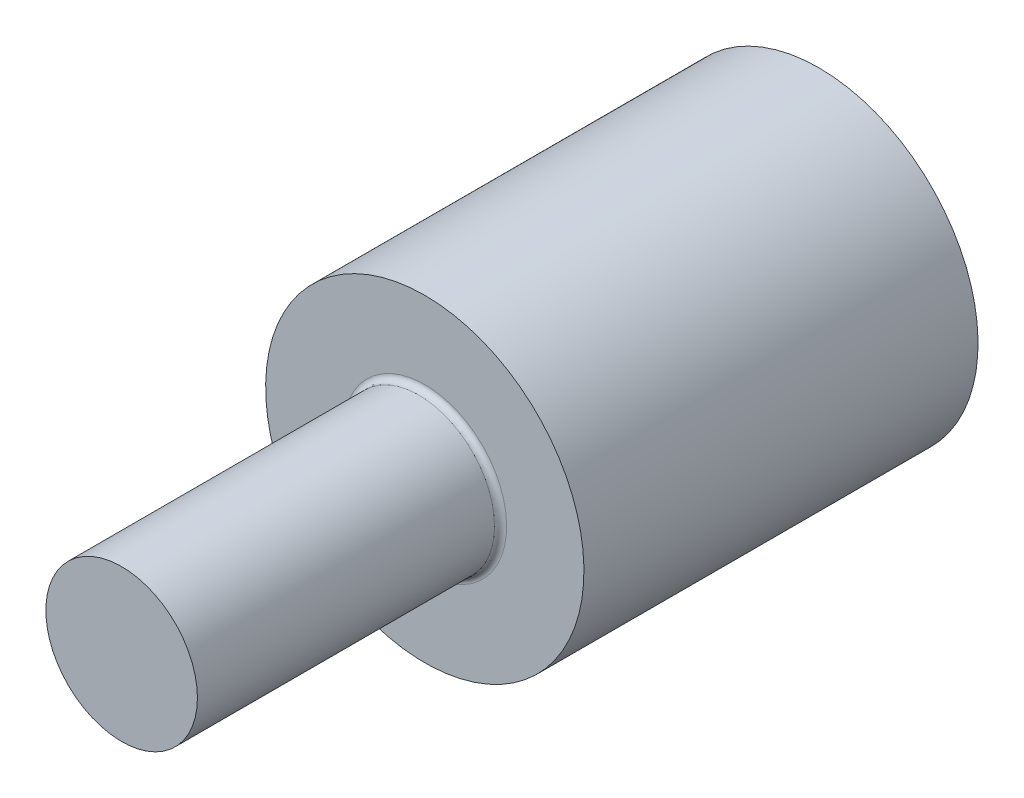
ISO-10303-21;
HEADER;
FILE_DESCRIPTION(('STEP AP214'),'2;1');
FILE_NAME('part.step','',(''),(''),'','','');
FILE_SCHEMA(('AUTOMOTIVE_DESIGN { 1 0 10303 214 1 1 1 1 }'));
ENDSEC;
DATA;
#1=APPLICATION_CONTEXT('core data for automotive mechanical design processes');
#2=APPLICATION_PROTOCOL_DEFINITION('international standard','automotive_design',2000,#1);
#3=PRODUCT_CONTEXT('',#1,'mechanical');
#4=PRODUCT('Part','Part','',(#3));
#5=PRODUCT_RELATED_PRODUCT_CATEGORY('part','',(#4));
#6=PRODUCT_DEFINITION_FORMATION('','',#4);
#7=PRODUCT_DEFINITION_CONTEXT('part definition',#1,'design');
#8=PRODUCT_DEFINITION('design','',#6,#7);
#9=PRODUCT_DEFINITION_SHAPE('','',#8);
#10=(LENGTH_UNIT() NAMED_UNIT(*) SI_UNIT(.MILLI.,.METRE.));
#11=(NAMED_UNIT(*) PLANE_ANGLE_UNIT() SI_UNIT($,.RADIAN.));
#12=(NAMED_UNIT(*) SI_UNIT($,.STERADIAN.) SOLID_ANGLE_UNIT());
#13=UNCERTAINTY_MEASURE_WITH_UNIT(LENGTH_MEASURE(1.E-05),#10,'distance_accuracy_value','');
#14=(GEOMETRIC_REPRESENTATION_CONTEXT(3) GLOBAL_UNCERTAINTY_ASSIGNED_CONTEXT((#13)) GLOBAL_UNIT_ASSIGNED_CONTEXT((#10,
#11,#12)) REPRESENTATION_CONTEXT('',''));
#15=CARTESIAN_POINT('',(0.,0.,0.));
#16=DIRECTION('',(0.,0.,1.));
#17=DIRECTION('',(1.,0.,0.));
#18=AXIS2_PLACEMENT_3D('',#15,#16,#17);
#19=CARTESIAN_POINT('',(0.,0.,17.));
#20=DIRECTION('',(0.,0.,1.));
#21=DIRECTION('',(0.,1.,0.));
#22=AXIS2_PLACEMENT_3D('',#19,#20,#21);
#23=CYLINDRICAL_SURFACE('',#22,2.5);
#24=CARTESIAN_POINT('',(0.,0.,17.));
#25=DIRECTION('',(0.,0.,1.));
#26=DIRECTION('',(1.,0.,0.));
#27=AXIS2_PLACEMENT_3D('',#24,#25,#26);
#28=CIRCLE('',#27,2.5);
#29=CARTESIAN_POINT('',(2.5,0.,17.));
#30=VERTEX_POINT('',#29);
#31=EDGE_CURVE('E31',#30,#30,#28,.T.);
#32=ORIENTED_EDGE('',*,*,#31,.F.);
#33=EDGE_LOOP('',(#32));
#34=FACE_BOUND('',#33,.T.);
#35=CARTESIAN_POINT('',(0.,0.,7.2));
#36=DIRECTION('',(0.,0.,-1.));
#37=DIRECTION('',(0.,-1.,0.));
#38=AXIS2_PLACEMENT_3D('',#35,#36,#37);
#39=CIRCLE('',#38,2.5);
#40=CARTESIAN_POINT('',(0.,-2.5,7.2));
#41=VERTEX_POINT('',#40);
#42=EDGE_CURVE('E19',#41,#41,#39,.F.);
#43=ORIENTED_EDGE('',*,*,#42,.T.);
#44=EDGE_LOOP('',(#43));
#45=FACE_BOUND('',#44,.T.);
#46=ADVANCED_FACE('F12',(#34,#45),#23,.T.);
#47=CARTESIAN_POINT('',(-2.5,0.,7.));
#48=DIRECTION('',(0.,0.,-1.));
#49=DIRECTION('',(0.,-1.,0.));
#50=AXIS2_PLACEMENT_3D('',#47,#48,#49);
#51=PLANE('',#50);
#52=CARTESIAN_POINT('',(0.,0.,7.));
#53=DIRECTION('',(0.,0.,-1.));
#54=DIRECTION('',(0.,-1.,0.));
#55=AXIS2_PLACEMENT_3D('',#52,#53,#54);
#56=CIRCLE('',#55,2.7);
#57=CARTESIAN_POINT('',(0.,-2.7,7.));
#58=VERTEX_POINT('',#57);
#59=EDGE_CURVE('E8',#58,#58,#56,.T.);
#60=ORIENTED_EDGE('',*,*,#59,.T.);
#61=EDGE_LOOP('',(#60));
#62=FACE_BOUND('',#61,.T.);
#63=CARTESIAN_POINT('',(0.,0.,7.));
#64=DIRECTION('',(0.,0.,-1.));
#65=DIRECTION('',(0.,1.,0.));
#66=AXIS2_PLACEMENT_3D('',#63,#64,#65);
#67=CIRCLE('',#66,5.25);
#68=CARTESIAN_POINT('',(0.,5.25,7.));
#69=VERTEX_POINT('',#68);
#70=EDGE_CURVE('E23',#69,#69,#67,.T.);
#71=ORIENTED_EDGE('',*,*,#70,.F.);
#72=EDGE_LOOP('',(#71));
#73=FACE_BOUND('',#72,.T.);
#74=ADVANCED_FACE('F39',(#62,#73),#51,.F.);
#75=CARTESIAN_POINT('',(0.,0.,7.2));
#76=DIRECTION('',(0.,0.,-1.));
#77=DIRECTION('',(0.,-1.,0.));
#78=AXIS2_PLACEMENT_3D('',#75,#76,#77);
#79=TOROIDAL_SURFACE('',#78,2.7,0.2);
#80=ORIENTED_EDGE('',*,*,#59,.F.);
#81=EDGE_LOOP('',(#80));
#82=FACE_BOUND('',#81,.T.);
#83=ORIENTED_EDGE('',*,*,#42,.F.);
#84=EDGE_LOOP('',(#83));
#85=FACE_BOUND('',#84,.T.);
#86=ADVANCED_FACE('F14',(#82,#85),#79,.F.);
#87=CARTESIAN_POINT('',(0.,0.,17.));
#88=DIRECTION('',(0.,0.,1.));
#89=DIRECTION('',(0.,1.,0.));
#90=AXIS2_PLACEMENT_3D('',#87,#88,#89);
#91=CYLINDRICAL_SURFACE('',#90,5.25);
#92=CARTESIAN_POINT('',(0.,0.,-6.));
#93=DIRECTION('',(0.,0.,-1.));
#94=DIRECTION('',(0.,1.,0.));
#95=AXIS2_PLACEMENT_3D('',#92,#93,#94);
#96=CIRCLE('',#95,5.25);
#97=CARTESIAN_POINT('',(0.,5.25,-6.));
#98=VERTEX_POINT('',#97);
#99=EDGE_CURVE('E27',#98,#98,#96,.T.);
#100=ORIENTED_EDGE('',*,*,#99,.F.);
#101=EDGE_LOOP('',(#100));
#102=FACE_BOUND('',#101,.T.);
#103=ORIENTED_EDGE('',*,*,#70,.T.);
#104=EDGE_LOOP('',(#103));
#105=FACE_BOUND('',#104,.T.);
#106=ADVANCED_FACE('F52',(#102,#105),#91,.T.);
#107=CARTESIAN_POINT('',(-5.25,0.,-6.));
#108=DIRECTION('',(0.,0.,1.));
#109=DIRECTION('',(0.,1.,0.));
#110=AXIS2_PLACEMENT_3D('',#107,#108,#109);
#111=PLANE('',#110);
#112=ORIENTED_EDGE('',*,*,#99,.T.);
#113=EDGE_LOOP('',(#112));
#114=FACE_BOUND('',#113,.T.);
#115=ADVANCED_FACE('F48',(#114),#111,.F.);
#116=CARTESIAN_POINT('',(0.,0.,17.));
#117=DIRECTION('',(0.,0.,-1.));
#118=DIRECTION('',(0.,-1.,0.));
#119=AXIS2_PLACEMENT_3D('',#116,#117,#118);
#120=PLANE('',#119);
#121=ORIENTED_EDGE('',*,*,#31,.T.);
#122=EDGE_LOOP('',(#121));
#123=FACE_BOUND('',#122,.T.);
#124=ADVANCED_FACE('F36',(#123),#120,.F.);
#125=CLOSED_SHELL('',(#46,#74,#86,#106,#115,#124));
#126=MANIFOLD_SOLID_BREP('B1',#125);
#127=ADVANCED_BREP_SHAPE_REPRESENTATION('',(#18,#126),#14);
#128=SHAPE_DEFINITION_REPRESENTATION(#9,#127);
ENDSEC;
END-ISO-10303-21;
